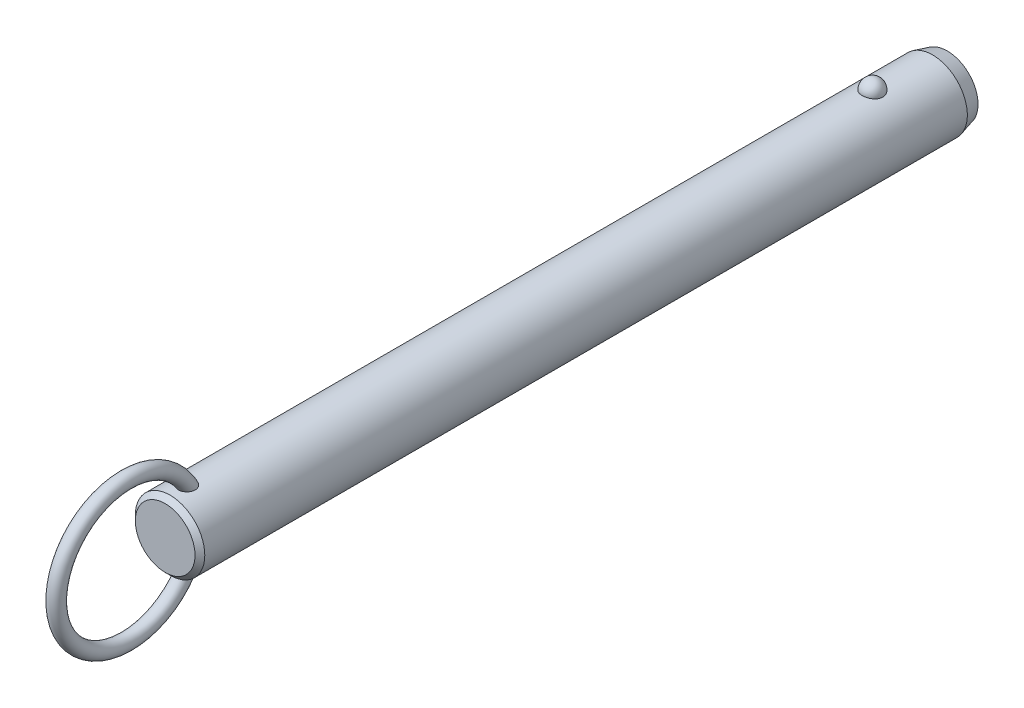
ISO-10303-21;
HEADER;
FILE_DESCRIPTION(('STEP AP214'),'2;1');
FILE_NAME('part.step','',(''),(''),'','','');
FILE_SCHEMA(('AUTOMOTIVE_DESIGN { 1 0 10303 214 1 1 1 1 }'));
ENDSEC;
DATA;
#1=APPLICATION_CONTEXT('core data for automotive mechanical design processes');
#2=APPLICATION_PROTOCOL_DEFINITION('international standard','automotive_design',2000,#1);
#3=PRODUCT_CONTEXT('',#1,'mechanical');
#4=PRODUCT('Part','Part','',(#3));
#5=PRODUCT_RELATED_PRODUCT_CATEGORY('part','',(#4));
#6=PRODUCT_DEFINITION_FORMATION('','',#4);
#7=PRODUCT_DEFINITION_CONTEXT('part definition',#1,'design');
#8=PRODUCT_DEFINITION('design','',#6,#7);
#9=PRODUCT_DEFINITION_SHAPE('','',#8);
#10=(LENGTH_UNIT() NAMED_UNIT(*) SI_UNIT(.MILLI.,.METRE.));
#11=(NAMED_UNIT(*) PLANE_ANGLE_UNIT() SI_UNIT($,.RADIAN.));
#12=(NAMED_UNIT(*) SI_UNIT($,.STERADIAN.) SOLID_ANGLE_UNIT());
#13=UNCERTAINTY_MEASURE_WITH_UNIT(LENGTH_MEASURE(1.E-05),#10,'distance_accuracy_value','');
#14=(GEOMETRIC_REPRESENTATION_CONTEXT(3) GLOBAL_UNCERTAINTY_ASSIGNED_CONTEXT((#13)) GLOBAL_UNIT_ASSIGNED_CONTEXT((#10,
#11,#12)) REPRESENTATION_CONTEXT('',''));
#15=CARTESIAN_POINT('',(0.,0.,0.));
#16=DIRECTION('',(0.,0.,1.));
#17=DIRECTION('',(1.,0.,0.));
#18=AXIS2_PLACEMENT_3D('',#15,#16,#17);
#19=CARTESIAN_POINT('',(0.,0.,134.6));
#20=DIRECTION('',(0.,0.,-1.));
#21=DIRECTION('',(-1.,0.,0.));
#22=AXIS2_PLACEMENT_3D('',#19,#20,#21);
#23=CYLINDRICAL_SURFACE('',#22,7.1);
#24=CARTESIAN_POINT('',(2.0769088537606,6.78943661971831,-2.1));
#25=CARTESIAN_POINT('',(2.07690739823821,6.78943796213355,-1.98268154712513));
#26=CARTESIAN_POINT('',(2.06738130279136,6.79237331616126,-1.86534506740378));
#27=CARTESIAN_POINT('',(2.0295040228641,6.8037853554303,-1.63400788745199));
#28=CARTESIAN_POINT('',(2.00114757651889,6.81226358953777,-1.52000812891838));
#29=CARTESIAN_POINT('',(1.92632025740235,6.83379798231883,-1.29863433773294));
#30=CARTESIAN_POINT('',(1.87985726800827,6.84685214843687,-1.19125744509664));
#31=CARTESIAN_POINT('',(1.76995205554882,6.87608091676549,-0.98604657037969));
#32=CARTESIAN_POINT('',(1.70650980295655,6.8922555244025,-0.88821260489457));
#33=CARTESIAN_POINT('',(1.5638119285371,6.92602930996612,-0.704242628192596));
#34=CARTESIAN_POINT('',(1.4844714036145,6.94363582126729,-0.618173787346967));
#35=CARTESIAN_POINT('',(1.31221746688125,6.97823658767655,-0.460740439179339));
#36=CARTESIAN_POINT('',(1.21930409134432,6.99523084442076,-0.389375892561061));
#37=CARTESIAN_POINT('',(1.02268781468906,7.02666176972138,-0.263547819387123));
#38=CARTESIAN_POINT('',(0.91902009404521,7.04110638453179,-0.209031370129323));
#39=CARTESIAN_POINT('',(0.703548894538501,7.06588726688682,-0.118163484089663));
#40=CARTESIAN_POINT('',(0.591746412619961,7.07622403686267,-0.0818098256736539));
#41=CARTESIAN_POINT('',(0.365557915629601,7.09147068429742,-0.0288711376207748));
#42=CARTESIAN_POINT('',(0.251267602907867,7.09648447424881,-0.0119070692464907));
#43=CARTESIAN_POINT('',(0.0213499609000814,7.10089837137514,0.00304925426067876));
#44=CARTESIAN_POINT('',(-0.0942772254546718,7.10029907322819,0.00104351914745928));
#45=CARTESIAN_POINT('',(-0.321651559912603,7.09360829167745,-0.0216931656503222));
#46=CARTESIAN_POINT('',(-0.433431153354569,7.08760388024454,-0.0421272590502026));
#47=CARTESIAN_POINT('',(-0.651862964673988,7.07086131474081,-0.100729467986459));
#48=CARTESIAN_POINT('',(-0.758515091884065,7.06012307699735,-0.138897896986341));
#49=CARTESIAN_POINT('',(-0.964449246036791,7.03496097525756,-0.232213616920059));
#50=CARTESIAN_POINT('',(-1.06368095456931,7.02051445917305,-0.287465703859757));
#51=CARTESIAN_POINT('',(-1.25145353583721,6.98948740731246,-0.413383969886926));
#52=CARTESIAN_POINT('',(-1.33999321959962,6.97290663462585,-0.48405186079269));
#53=CARTESIAN_POINT('',(-1.50591604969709,6.93898770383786,-0.640594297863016));
#54=CARTESIAN_POINT('',(-1.58302488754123,6.92164094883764,-0.726757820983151));
#55=CARTESIAN_POINT('',(-1.72189320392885,6.8884103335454,-0.91092752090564));
#56=CARTESIAN_POINT('',(-1.78365144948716,6.87252659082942,-1.008934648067));
#57=CARTESIAN_POINT('',(-1.89101272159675,6.84377189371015,-1.21549497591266));
#58=CARTESIAN_POINT('',(-1.93639553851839,6.83094274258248,-1.32416860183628));
#59=CARTESIAN_POINT('',(-2.00874275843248,6.81002070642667,-1.54791500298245));
#60=CARTESIAN_POINT('',(-2.03570774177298,6.80192767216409,-1.66298757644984));
#61=CARTESIAN_POINT('',(-2.07047276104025,6.7914266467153,-1.89571453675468));
#62=CARTESIAN_POINT('',(-2.07835878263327,6.78899315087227,-2.01335491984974));
#63=CARTESIAN_POINT('',(-2.07502083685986,6.79001409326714,-2.24833570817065));
#64=CARTESIAN_POINT('',(-2.06379746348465,6.7934683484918,-2.36567612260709));
#65=CARTESIAN_POINT('',(-2.02263913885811,6.80583442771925,-2.59603194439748));
#66=CARTESIAN_POINT('',(-1.99281127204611,6.81471501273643,-2.70906820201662));
#67=CARTESIAN_POINT('',(-1.91526639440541,6.83691232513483,-2.92836575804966));
#68=CARTESIAN_POINT('',(-1.8675486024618,6.85022924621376,-3.03462676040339));
#69=CARTESIAN_POINT('',(-1.75504492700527,6.87991336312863,-3.23806487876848));
#70=CARTESIAN_POINT('',(-1.69015924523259,6.89629822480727,-3.33518422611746));
#71=CARTESIAN_POINT('',(-1.54505404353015,6.93024852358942,-3.51697105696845));
#72=CARTESIAN_POINT('',(-1.46483385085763,6.94781401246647,-3.60163799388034));
#73=CARTESIAN_POINT('',(-1.29071406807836,6.98225977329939,-3.75654119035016));
#74=CARTESIAN_POINT('',(-1.19675650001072,6.99913673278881,-3.82671308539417));
#75=CARTESIAN_POINT('',(-0.997940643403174,7.03023618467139,-3.9501837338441));
#76=CARTESIAN_POINT('',(-0.89308318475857,7.04445887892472,-4.00348377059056));
#77=CARTESIAN_POINT('',(-0.676902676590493,7.06848365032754,-4.09107242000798));
#78=CARTESIAN_POINT('',(-0.565686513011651,7.0783430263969,-4.12560889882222));
#79=CARTESIAN_POINT('',(-0.338739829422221,7.09282534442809,-4.17575450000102));
#80=CARTESIAN_POINT('',(-0.223009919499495,7.09744899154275,-4.19136617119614));
#81=CARTESIAN_POINT('',(0.00707628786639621,7.10090930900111,-4.20307965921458));
#82=CARTESIAN_POINT('',(0.121410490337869,7.09986531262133,-4.19958377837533));
#83=CARTESIAN_POINT('',(0.347815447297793,7.092380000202,-4.17411564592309));
#84=CARTESIAN_POINT('',(0.459886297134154,7.08593891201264,-4.15214417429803));
#85=CARTESIAN_POINT('',(0.678084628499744,7.06838983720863,-4.09049562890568));
#86=CARTESIAN_POINT('',(0.784237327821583,7.05730369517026,-4.05090137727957));
#87=CARTESIAN_POINT('',(0.988305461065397,7.03163139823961,-3.95511447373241));
#88=CARTESIAN_POINT('',(1.08622031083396,7.01704499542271,-3.89892064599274));
#89=CARTESIAN_POINT('',(1.27284490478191,6.98562668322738,-3.77035541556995));
#90=CARTESIAN_POINT('',(1.36137372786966,6.96876135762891,-3.69772964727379));
#91=CARTESIAN_POINT('',(1.52509486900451,6.93477412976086,-3.53878279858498));
#92=CARTESIAN_POINT('',(1.60028496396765,6.91765218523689,-3.45245943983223));
#93=CARTESIAN_POINT('',(1.73681688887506,6.88465753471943,-3.26658774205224));
#94=CARTESIAN_POINT('',(1.79785966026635,6.86881574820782,-3.16681408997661));
#95=CARTESIAN_POINT('',(1.90265327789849,6.84053157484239,-2.95814408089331));
#96=CARTESIAN_POINT('',(1.94640861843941,6.82808830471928,-2.84925010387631));
#97=CARTESIAN_POINT('',(2.01274378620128,6.80881460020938,-2.63454318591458));
#98=CARTESIAN_POINT('',(2.03676193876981,6.80160856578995,-2.52920574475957));
#99=CARTESIAN_POINT('',(2.06884490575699,6.79191902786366,-2.3159172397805));
#100=CARTESIAN_POINT('',(2.07691019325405,6.78943538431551,-2.20796625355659));
#101=CARTESIAN_POINT('',(2.0769088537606,6.78943661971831,-2.1));
#102=B_SPLINE_CURVE_WITH_KNOTS('',3,(#24,#25,#26,#27,#28,#29,#30,#31,#32,#33,#34,#35,#36,#37,
#38,#39,#40,#41,#42,#43,#44,#45,#46,#47,#48,#49,#50,#51,#52,#53,#54,#55,#56,#57,#58,#59,#60,#61,
#62,#63,#64,#65,#66,#67,#68,#69,#70,#71,#72,#73,#74,#75,#76,#77,#78,#79,#80,#81,#82,#83,#84,#85,
#86,#87,#88,#89,#90,#91,#92,#93,#94,#95,#96,#97,#98,#99,#100,#101),.UNSPECIFIED.,.T.,.F.,(4,2,2,
2,2,2,2,2,2,2,2,2,2,2,2,2,2,2,2,2,2,2,2,2,2,2,2,2,2,2,2,2,2,2,2,2,2,2,4),(0.,0.351568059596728,
0.703234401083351,1.05474780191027,1.40626181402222,1.75970563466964,2.11314851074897,
2.4654696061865,2.81774759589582,3.16301449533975,3.50824481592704,3.84801136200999,
4.18778391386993,4.52968352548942,4.87162112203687,5.22076181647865,5.56993054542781,
5.92363364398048,6.27732559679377,6.62942052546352,6.98150450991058,7.33158042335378,
7.68167162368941,8.03384443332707,8.38603269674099,8.73975272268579,9.09344583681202,
9.44234545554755,9.79119807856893,10.1327344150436,10.4742563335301,10.8141898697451,
11.1541474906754,11.4997793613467,11.8454687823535,12.1979079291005,12.5502553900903,
12.8738073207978,13.1973496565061),.UNSPECIFIED.);
#103=CARTESIAN_POINT('',(2.0769088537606,6.78943661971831,-2.1));
#104=VERTEX_POINT('',#103);
#105=EDGE_CURVE('E41',#104,#104,#102,.T.);
#106=ORIENTED_EDGE('',*,*,#105,.T.);
#107=EDGE_LOOP('',(#106));
#108=FACE_BOUND('',#107,.T.);
#109=CARTESIAN_POINT('',(0.,0.,141.52));
#110=DIRECTION('',(0.,0.,1.));
#111=DIRECTION('',(1.,0.,0.));
#112=AXIS2_PLACEMENT_3D('',#109,#110,#111);
#113=CIRCLE('',#112,7.1);
#114=CARTESIAN_POINT('',(7.1,0.,141.52));
#115=VERTEX_POINT('',#114);
#116=EDGE_CURVE('E10',#115,#115,#113,.F.);
#117=ORIENTED_EDGE('',*,*,#116,.T.);
#118=EDGE_LOOP('',(#117));
#119=FACE_BOUND('',#118,.T.);
#120=CARTESIAN_POINT('',(-0.429539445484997,-7.08699541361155,136.342921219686));
#121=CARTESIAN_POINT('',(-0.508331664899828,-7.08221999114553,136.366876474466));
#122=CARTESIAN_POINT('',(-0.585039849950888,-7.07624016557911,136.397457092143));
#123=CARTESIAN_POINT('',(-0.73208265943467,-7.06254296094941,136.471024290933));
#124=CARTESIAN_POINT('',(-0.802417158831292,-7.05482554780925,136.514011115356));
#125=CARTESIAN_POINT('',(-0.934722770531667,-7.03851844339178,136.611113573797));
#126=CARTESIAN_POINT('',(-0.996700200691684,-7.02992941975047,136.665220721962));
#127=CARTESIAN_POINT('',(-1.11079942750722,-7.01280697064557,136.782967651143));
#128=CARTESIAN_POINT('',(-1.16292136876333,-7.00427354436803,136.846607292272));
#129=CARTESIAN_POINT('',(-1.25705660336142,-6.98799959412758,136.982687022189));
#130=CARTESIAN_POINT('',(-1.29888032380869,-6.98027525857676,137.055259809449));
#131=CARTESIAN_POINT('',(-1.37069920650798,-6.96652886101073,137.206168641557));
#132=CARTESIAN_POINT('',(-1.40069157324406,-6.96050720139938,137.284506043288));
#133=CARTESIAN_POINT('',(-1.45043507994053,-6.95031881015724,137.450190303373));
#134=CARTESIAN_POINT('',(-1.46937115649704,-6.94630231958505,137.537789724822));
#135=CARTESIAN_POINT('',(-1.49424917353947,-6.94099239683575,137.714871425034));
#136=CARTESIAN_POINT('',(-1.50018601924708,-6.93970003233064,137.804354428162));
#137=CARTESIAN_POINT('',(-1.49978214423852,-6.93978815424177,137.994060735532));
#138=CARTESIAN_POINT('',(-1.49187639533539,-6.94150934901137,138.094279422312));
#139=CARTESIAN_POINT('',(-1.46177925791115,-6.94790814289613,138.292479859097));
#140=CARTESIAN_POINT('',(-1.43957541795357,-6.95258831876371,138.390459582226));
#141=CARTESIAN_POINT('',(-1.37783293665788,-6.96510647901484,138.59536292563));
#142=CARTESIAN_POINT('',(-1.33634073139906,-6.97328848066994,138.701680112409));
#143=CARTESIAN_POINT('',(-1.23686994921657,-6.99161706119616,138.906177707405));
#144=CARTESIAN_POINT('',(-1.17889192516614,-7.00176357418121,139.004358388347));
#145=CARTESIAN_POINT('',(-1.05875124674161,-7.02082898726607,139.172374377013));
#146=CARTESIAN_POINT('',(-0.999247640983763,-7.02963746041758,139.244123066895));
#147=CARTESIAN_POINT('',(-0.869494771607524,-7.04686074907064,139.377195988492));
#148=CARTESIAN_POINT('',(-0.799263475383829,-7.05527619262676,139.438537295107));
#149=CARTESIAN_POINT('',(-0.665408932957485,-7.06899457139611,139.535131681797));
#150=CARTESIAN_POINT('',(-0.603817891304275,-7.07457275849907,139.573151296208));
#151=CARTESIAN_POINT('',(-0.475172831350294,-7.08437420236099,139.638758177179));
#152=CARTESIAN_POINT('',(-0.4081230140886,-7.08859848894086,139.666353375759));
#153=CARTESIAN_POINT('',(-0.26943193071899,-7.09522749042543,139.709256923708));
#154=CARTESIAN_POINT('',(-0.197757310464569,-7.09761688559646,139.724461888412));
#155=CARTESIAN_POINT('',(-0.05278498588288,-7.10017268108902,139.740716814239));
#156=CARTESIAN_POINT('',(0.020511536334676,-7.10034065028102,139.741776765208));
#157=CARTESIAN_POINT('',(0.156426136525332,-7.09855986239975,139.730461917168));
#158=CARTESIAN_POINT('',(0.219199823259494,-7.09688191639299,139.719806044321));
#159=CARTESIAN_POINT('',(0.342134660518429,-7.09201880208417,139.688537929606));
#160=CARTESIAN_POINT('',(0.402295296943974,-7.08883333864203,139.667923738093));
#161=CARTESIAN_POINT('',(0.520687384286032,-7.08113868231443,139.617212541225));
#162=CARTESIAN_POINT('',(0.578791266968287,-7.07658958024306,139.586827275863));
#163=CARTESIAN_POINT('',(0.69017323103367,-7.06659708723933,139.518367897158));
#164=CARTESIAN_POINT('',(0.743447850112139,-7.061153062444,139.480288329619));
#165=CARTESIAN_POINT('',(0.87094790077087,-7.04680292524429,139.376592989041));
#166=CARTESIAN_POINT('',(0.941828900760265,-7.03755800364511,139.306897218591));
#167=CARTESIAN_POINT('',(1.07136606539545,-7.01900793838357,139.156945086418));
#168=CARTESIAN_POINT('',(1.13000013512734,-7.00970271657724,139.076670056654));
#169=CARTESIAN_POINT('',(1.23579584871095,-6.99183327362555,138.906899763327));
#170=CARTESIAN_POINT('',(1.28274271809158,-6.98328455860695,138.817269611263));
#171=CARTESIAN_POINT('',(1.3635144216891,-6.96796352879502,138.632176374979));
#172=CARTESIAN_POINT('',(1.39733971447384,-6.96119115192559,138.536713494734));
#173=CARTESIAN_POINT('',(1.45579181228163,-6.94922464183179,138.32530928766));
#174=CARTESIAN_POINT('',(1.47790145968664,-6.94449000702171,138.208631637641));
#175=CARTESIAN_POINT('',(1.50168752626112,-6.93938731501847,137.973015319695));
#176=CARTESIAN_POINT('',(1.50336085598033,-6.93901991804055,137.85407631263));
#177=CARTESIAN_POINT('',(1.48486516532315,-6.9430010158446,137.62360799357));
#178=CARTESIAN_POINT('',(1.46573441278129,-6.9471253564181,137.511995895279));
#179=CARTESIAN_POINT('',(1.40606892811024,-6.95944667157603,137.294886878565));
#180=CARTESIAN_POINT('',(1.36556446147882,-6.96763788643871,137.1893815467));
#181=CARTESIAN_POINT('',(1.2708270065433,-6.98548038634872,137.004287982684));
#182=CARTESIAN_POINT('',(1.21949810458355,-6.99473841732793,136.923171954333));
#183=CARTESIAN_POINT('',(1.10242050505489,-7.0141406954,136.772227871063));
#184=CARTESIAN_POINT('',(1.03668119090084,-7.02428436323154,136.70239252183));
#185=CARTESIAN_POINT('',(0.900559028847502,-7.04295285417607,136.583573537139));
#186=CARTESIAN_POINT('',(0.831428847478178,-7.05153466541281,136.533157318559));
#187=CARTESIAN_POINT('',(0.685291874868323,-7.06723150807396,136.445142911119));
#188=CARTESIAN_POINT('',(0.608287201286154,-7.07434693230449,136.407541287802));
#189=CARTESIAN_POINT('',(0.451878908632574,-7.08602232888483,136.347491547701));
#190=CARTESIAN_POINT('',(0.372686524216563,-7.09067127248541,136.324508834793));
#191=CARTESIAN_POINT('',(0.211477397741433,-7.09730788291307,136.292035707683));
#192=CARTESIAN_POINT('',(0.129460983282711,-7.09929585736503,136.28254373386));
#193=CARTESIAN_POINT('',(-0.0332905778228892,-7.10037858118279,136.277351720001));
#194=CARTESIAN_POINT('',(-0.114016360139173,-7.09953334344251,136.281365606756));
#195=CARTESIAN_POINT('',(-0.27367033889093,-7.09517338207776,136.302454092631));
#196=CARTESIAN_POINT('',(-0.352598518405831,-7.09165863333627,136.319528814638));
#197=CARTESIAN_POINT('',(-0.429539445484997,-7.08699541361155,136.342921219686));
#198=B_SPLINE_CURVE_WITH_KNOTS('',3,(#120,#121,#122,#123,#124,#125,#126,#127,#128,#129,#130,
#131,#132,#133,#134,#135,#136,#137,#138,#139,#140,#141,#142,#143,#144,#145,#146,#147,#148,#149,
#150,#151,#152,#153,#154,#155,#156,#157,#158,#159,#160,#161,#162,#163,#164,#165,#166,#167,#168,
#169,#170,#171,#172,#173,#174,#175,#176,#177,#178,#179,#180,#181,#182,#183,#184,#185,#186,#187,
#188,#189,#190,#191,#192,#193,#194,#195,#196,#197),.UNSPECIFIED.,.T.,.F.,(4,2,2,2,2,2,2,2,2,2,2,
2,2,2,2,2,2,2,2,2,2,2,2,2,2,2,2,2,2,2,2,2,2,2,2,2,2,2,4),(0.,0.247183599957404,
0.494372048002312,0.741372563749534,0.988369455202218,1.23962059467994,1.490931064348,
1.75897818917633,2.02713035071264,2.3275826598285,2.62829697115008,2.97008736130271,
3.31186629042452,3.59175319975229,3.87117637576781,4.08813841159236,4.30493502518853,
4.5235225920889,4.74195577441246,4.93215328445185,5.12238804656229,5.318848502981,
5.51544871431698,5.81332317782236,6.11173048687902,6.41527266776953,6.71880423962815,
7.07358156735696,7.42841252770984,7.76631485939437,8.10373999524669,8.39142246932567,
8.67891817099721,8.93560332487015,9.19221962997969,9.43881106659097,9.68537399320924,
9.92674752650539,10.1681233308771),.UNSPECIFIED.);
#199=CARTESIAN_POINT('',(-0.429539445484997,-7.08699541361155,136.342921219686));
#200=VERTEX_POINT('',#199);
#201=EDGE_CURVE('E60',#200,#200,#198,.T.);
#202=ORIENTED_EDGE('',*,*,#201,.T.);
#203=EDGE_LOOP('',(#202));
#204=FACE_BOUND('',#203,.T.);
#205=CARTESIAN_POINT('',(-0.429539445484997,7.08699541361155,136.342921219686));
#206=CARTESIAN_POINT('',(-0.351665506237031,7.09171429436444,136.319246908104));
#207=CARTESIAN_POINT('',(-0.271733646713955,7.09525896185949,136.302036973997));
#208=CARTESIAN_POINT('',(-0.110026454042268,7.09960839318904,136.281005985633));
#209=CARTESIAN_POINT('',(-0.0282502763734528,7.10041187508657,136.277191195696));
#210=CARTESIAN_POINT('',(0.134782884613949,7.09918849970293,136.283059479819));
#211=CARTESIAN_POINT('',(0.216039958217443,7.09716214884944,136.29274013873));
#212=CARTESIAN_POINT('',(0.375730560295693,7.09050177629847,136.325347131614));
#213=CARTESIAN_POINT('',(0.454164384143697,7.08586802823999,136.348272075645));
#214=CARTESIAN_POINT('',(0.606025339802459,7.07449911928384,136.406771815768));
#215=CARTESIAN_POINT('',(0.679451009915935,7.06776334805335,136.442350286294));
#216=CARTESIAN_POINT('',(0.81923414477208,7.05292866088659,136.525175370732));
#217=CARTESIAN_POINT('',(0.885591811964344,7.04482978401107,136.572421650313));
#218=CARTESIAN_POINT('',(1.00993211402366,7.02808709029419,136.677590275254));
#219=CARTESIAN_POINT('',(1.06785399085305,7.01943990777,136.735583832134));
#220=CARTESIAN_POINT('',(1.17342527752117,7.00256662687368,136.860301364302));
#221=CARTESIAN_POINT('',(1.22107408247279,6.99434055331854,136.927025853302));
#222=CARTESIAN_POINT('',(1.30652927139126,6.97889183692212,137.069362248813));
#223=CARTESIAN_POINT('',(1.34399711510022,6.97170674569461,137.145180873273));
#224=CARTESIAN_POINT('',(1.40682616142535,6.95930080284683,137.301810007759));
#225=CARTESIAN_POINT('',(1.43218374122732,6.95408053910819,137.38262200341));
#226=CARTESIAN_POINT('',(1.47246409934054,6.94566853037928,137.553531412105));
#227=CARTESIAN_POINT('',(1.48642590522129,6.9426653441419,137.64386307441));
#228=CARTESIAN_POINT('',(1.5011410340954,6.93949744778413,137.825619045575));
#229=CARTESIAN_POINT('',(1.50188917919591,6.93933385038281,137.917043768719));
#230=CARTESIAN_POINT('',(1.49030464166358,6.94183245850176,138.11084381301));
#231=CARTESIAN_POINT('',(1.47627413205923,6.94486147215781,138.213112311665));
#232=CARTESIAN_POINT('',(1.43356351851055,6.95380194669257,138.414471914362));
#233=CARTESIAN_POINT('',(1.4048676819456,6.95971650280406,138.513559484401));
#234=CARTESIAN_POINT('',(1.32908750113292,6.97461208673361,138.718908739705));
#235=CARTESIAN_POINT('',(1.28011435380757,6.98388945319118,138.824456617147));
#236=CARTESIAN_POINT('',(1.16520357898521,7.00397743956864,139.025760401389));
#237=CARTESIAN_POINT('',(1.09927694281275,7.01478706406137,139.121522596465));
#238=CARTESIAN_POINT('',(0.969361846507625,7.03373936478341,139.276756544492));
#239=CARTESIAN_POINT('',(0.909042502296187,7.04187023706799,139.339303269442));
#240=CARTESIAN_POINT('',(0.779178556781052,7.05741732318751,139.454053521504));
#241=CARTESIAN_POINT('',(0.709649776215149,7.06483472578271,139.506274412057));
#242=CARTESIAN_POINT('',(0.576854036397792,7.0767751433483,139.588113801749));
#243=CARTESIAN_POINT('',(0.515118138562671,7.08158033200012,139.620164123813));
#244=CARTESIAN_POINT('',(0.387127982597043,7.08972701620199,139.673765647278));
#245=CARTESIAN_POINT('',(0.320877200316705,7.09306962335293,139.695324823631));
#246=CARTESIAN_POINT('',(0.185041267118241,7.09791507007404,139.726400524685));
#247=CARTESIAN_POINT('',(0.115437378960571,7.09940591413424,139.735838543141));
#248=CARTESIAN_POINT('',(-0.024315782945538,7.10030171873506,139.741522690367));
#249=CARTESIAN_POINT('',(-0.0944648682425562,7.0997073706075,139.737773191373));
#250=CARTESIAN_POINT('',(-0.225713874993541,7.09668414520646,139.718508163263));
#251=CARTESIAN_POINT('',(-0.287006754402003,7.09444865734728,139.704232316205));
#252=CARTESIAN_POINT('',(-0.406555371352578,7.08860360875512,139.666368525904));
#253=CARTESIAN_POINT('',(-0.464809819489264,7.08499346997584,139.642776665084));
#254=CARTESIAN_POINT('',(-0.594955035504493,7.07541654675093,139.578923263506));
#255=CARTESIAN_POINT('',(-0.665389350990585,7.06906574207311,139.535753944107));
#256=CARTESIAN_POINT('',(-0.798242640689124,7.05530261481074,139.438587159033));
#257=CARTESIAN_POINT('',(-0.860645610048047,7.0478882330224,139.384568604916));
#258=CARTESIAN_POINT('',(-0.994249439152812,7.03045217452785,139.250996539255));
#259=CARTESIAN_POINT('',(-1.06260129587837,7.02030745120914,139.168614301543));
#260=CARTESIAN_POINT('',(-1.18502045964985,7.00068382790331,138.993843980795));
#261=CARTESIAN_POINT('',(-1.23907684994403,6.99120544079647,138.901448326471));
#262=CARTESIAN_POINT('',(-1.33335589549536,6.97384343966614,138.708008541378));
#263=CARTESIAN_POINT('',(-1.37336138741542,6.96598557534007,138.606856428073));
#264=CARTESIAN_POINT('',(-1.43770677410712,6.95299053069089,138.399504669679));
#265=CARTESIAN_POINT('',(-1.46204473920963,6.94785368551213,138.29330440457));
#266=CARTESIAN_POINT('',(-1.49537533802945,6.94076296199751,138.068231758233));
#267=CARTESIAN_POINT('',(-1.50273564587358,6.93914842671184,137.94909751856));
#268=CARTESIAN_POINT('',(-1.4954555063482,6.94072368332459,137.711470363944));
#269=CARTESIAN_POINT('',(-1.48082914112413,6.94391040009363,137.592977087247));
#270=CARTESIAN_POINT('',(-1.43076401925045,6.95438579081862,137.373432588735));
#271=CARTESIAN_POINT('',(-1.39762227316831,6.96121852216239,137.271841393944));
#272=CARTESIAN_POINT('',(-1.31211274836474,6.97783941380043,137.077351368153));
#273=CARTESIAN_POINT('',(-1.25976607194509,6.98762432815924,136.98444313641));
#274=CARTESIAN_POINT('',(-1.14583073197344,7.00713153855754,136.824160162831));
#275=CARTESIAN_POINT('',(-1.08665947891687,7.01665982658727,136.755035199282));
#276=CARTESIAN_POINT('',(-0.956606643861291,7.03556646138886,136.628878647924));
#277=CARTESIAN_POINT('',(-0.885737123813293,7.04494495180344,136.571834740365));
#278=CARTESIAN_POINT('',(-0.7515580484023,7.06035735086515,136.483100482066));
#279=CARTESIAN_POINT('',(-0.690120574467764,7.0666695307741,136.448593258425));
#280=CARTESIAN_POINT('',(-0.562815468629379,7.07794609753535,136.388750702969));
#281=CARTESIAN_POINT('',(-0.496948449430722,7.08291067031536,136.363414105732));
#282=CARTESIAN_POINT('',(-0.429539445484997,7.08699541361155,136.342921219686));
#283=B_SPLINE_CURVE_WITH_KNOTS('',3,(#205,#206,#207,#208,#209,#210,#211,#212,#213,#214,#215,
#216,#217,#218,#219,#220,#221,#222,#223,#224,#225,#226,#227,#228,#229,#230,#231,#232,#233,#234,
#235,#236,#237,#238,#239,#240,#241,#242,#243,#244,#245,#246,#247,#248,#249,#250,#251,#252,#253,
#254,#255,#256,#257,#258,#259,#260,#261,#262,#263,#264,#265,#266,#267,#268,#269,#270,#271,#272,
#273,#274,#275,#276,#277,#278,#279,#280,#281,#282),.UNSPECIFIED.,.T.,.F.,(4,2,2,2,2,2,2,2,2,2,2,
2,2,2,2,2,2,2,2,2,2,2,2,2,2,2,2,2,2,2,2,2,2,2,2,2,2,2,4),(0.,0.244335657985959,
0.488785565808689,0.733191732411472,0.977572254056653,1.22202379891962,1.46646834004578,
1.71259457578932,1.9587352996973,2.21226768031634,2.46587585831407,2.73913816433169,
3.01250754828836,3.32109936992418,3.63002293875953,3.9786351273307,4.32702187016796,
4.58793945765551,4.84841449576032,5.05676704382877,5.26496096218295,5.47449661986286,
5.68396281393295,5.87205447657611,6.06022532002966,6.30743751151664,6.55513496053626,
6.87602468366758,7.19715875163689,7.5230577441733,7.84899686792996,8.20516155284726,
8.56109821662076,8.88040084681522,9.19935367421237,9.47236282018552,9.74509220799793,
9.95662250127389,10.1681235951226),.UNSPECIFIED.);
#284=CARTESIAN_POINT('',(-0.429539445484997,7.08699541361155,136.342921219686));
#285=VERTEX_POINT('',#284);
#286=EDGE_CURVE('E67',#285,#285,#283,.T.);
#287=ORIENTED_EDGE('',*,*,#286,.T.);
#288=EDGE_LOOP('',(#287));
#289=FACE_BOUND('',#288,.T.);
#290=CARTESIAN_POINT('',(0.,0.,-14.4));
#291=DIRECTION('',(0.,0.,-1.));
#292=DIRECTION('',(-1.,0.,0.));
#293=AXIS2_PLACEMENT_3D('',#290,#291,#292);
#294=CIRCLE('',#293,7.1);
#295=CARTESIAN_POINT('',(-7.1,0.,-14.4));
#296=VERTEX_POINT('',#295);
#297=EDGE_CURVE('E57',#296,#296,#294,.F.);
#298=ORIENTED_EDGE('',*,*,#297,.T.);
#299=EDGE_LOOP('',(#298));
#300=FACE_BOUND('',#299,.T.);
#301=ADVANCED_FACE('F37',(#108,#119,#204,#289,#300),#23,.T.);
#302=CARTESIAN_POINT('',(0.,0.,-17.4));
#303=DIRECTION('',(0.,0.,-1.));
#304=DIRECTION('',(-1.,0.,0.));
#305=AXIS2_PLACEMENT_3D('',#302,#303,#304);
#306=PLANE('',#305);
#307=CARTESIAN_POINT('',(0.,0.,-17.4));
#308=DIRECTION('',(0.,0.,-1.));
#309=DIRECTION('',(-1.,0.,0.));
#310=AXIS2_PLACEMENT_3D('',#307,#308,#309);
#311=CIRCLE('',#310,6.29615242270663);
#312=CARTESIAN_POINT('',(-6.29615242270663,0.,-17.4));
#313=VERTEX_POINT('',#312);
#314=EDGE_CURVE('E66',#313,#313,#311,.T.);
#315=ORIENTED_EDGE('',*,*,#314,.T.);
#316=EDGE_LOOP('',(#315));
#317=FACE_BOUND('',#316,.T.);
#318=ADVANCED_FACE('F85',(#317),#306,.T.);
#319=CARTESIAN_POINT('',(0.,0.,-17.4));
#320=DIRECTION('',(0.,0.,1.));
#321=DIRECTION('',(1.,0.,0.));
#322=AXIS2_PLACEMENT_3D('',#319,#320,#321);
#323=CONICAL_SURFACE('',#322,6.29615242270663,0.261799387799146);
#324=ORIENTED_EDGE('',*,*,#297,.F.);
#325=EDGE_LOOP('',(#324));
#326=FACE_BOUND('',#325,.T.);
#327=ORIENTED_EDGE('',*,*,#314,.F.);
#328=EDGE_LOOP('',(#327));
#329=FACE_BOUND('',#328,.T.);
#330=ADVANCED_FACE('F83',(#326,#329),#323,.T.);
#331=CARTESIAN_POINT('',(0.,0.,142.52));
#332=DIRECTION('',(0.,0.,1.));
#333=DIRECTION('',(1.,0.,0.));
#334=AXIS2_PLACEMENT_3D('',#331,#332,#333);
#335=PLANE('',#334);
#336=CARTESIAN_POINT('',(0.,0.,142.52));
#337=DIRECTION('',(0.,0.,1.));
#338=DIRECTION('',(1.,0.,0.));
#339=AXIS2_PLACEMENT_3D('',#336,#337,#338);
#340=CIRCLE('',#339,6.10000000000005);
#341=CARTESIAN_POINT('',(6.10000000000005,0.,142.52));
#342=VERTEX_POINT('',#341);
#343=EDGE_CURVE('E50',#342,#342,#340,.T.);
#344=ORIENTED_EDGE('',*,*,#343,.T.);
#345=EDGE_LOOP('',(#344));
#346=FACE_BOUND('',#345,.T.);
#347=ADVANCED_FACE('F77',(#346),#335,.T.);
#348=CARTESIAN_POINT('',(0.,0.,150.45));
#349=DIRECTION('',(1.,0.,0.));
#350=DIRECTION('',(0.,0.,-1.));
#351=AXIS2_PLACEMENT_3D('',#348,#349,#350);
#352=TOROIDAL_SURFACE('',#351,14.35,1.5);
#353=ORIENTED_EDGE('',*,*,#286,.F.);
#354=EDGE_LOOP('',(#353));
#355=FACE_BOUND('',#354,.T.);
#356=ORIENTED_EDGE('',*,*,#201,.F.);
#357=EDGE_LOOP('',(#356));
#358=FACE_BOUND('',#357,.T.);
#359=ADVANCED_FACE('F73',(#355,#358),#352,.T.);
#360=CARTESIAN_POINT('',(0.,0.,142.52));
#361=DIRECTION('',(0.,0.,-1.));
#362=DIRECTION('',(-1.,0.,0.));
#363=AXIS2_PLACEMENT_3D('',#360,#361,#362);
#364=CONICAL_SURFACE('',#363,6.10000000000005,0.785398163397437);
#365=ORIENTED_EDGE('',*,*,#116,.F.);
#366=EDGE_LOOP('',(#365));
#367=FACE_BOUND('',#366,.T.);
#368=ORIENTED_EDGE('',*,*,#343,.F.);
#369=EDGE_LOOP('',(#368));
#370=FACE_BOUND('',#369,.T.);
#371=ADVANCED_FACE('F39',(#367,#370),#364,.T.);
#372=CARTESIAN_POINT('',(0.,7.1,-2.1));
#373=DIRECTION('',(0.,1.,0.));
#374=DIRECTION('',(0.,0.,1.));
#375=AXIS2_PLACEMENT_3D('',#372,#373,#374);
#376=SPHERICAL_SURFACE('',#375,2.10000000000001);
#377=ORIENTED_EDGE('',*,*,#105,.F.);
#378=EDGE_LOOP('',(#377));
#379=FACE_BOUND('',#378,.T.);
#380=ADVANCED_FACE('F79',(#379),#376,.T.);
#381=CLOSED_SHELL('',(#301,#318,#330,#347,#359,#371,#380));
#382=MANIFOLD_SOLID_BREP('B2',#381);
#383=ADVANCED_BREP_SHAPE_REPRESENTATION('',(#18,#382),#14);
#384=SHAPE_DEFINITION_REPRESENTATION(#9,#383);
ENDSEC;
END-ISO-10303-21;
